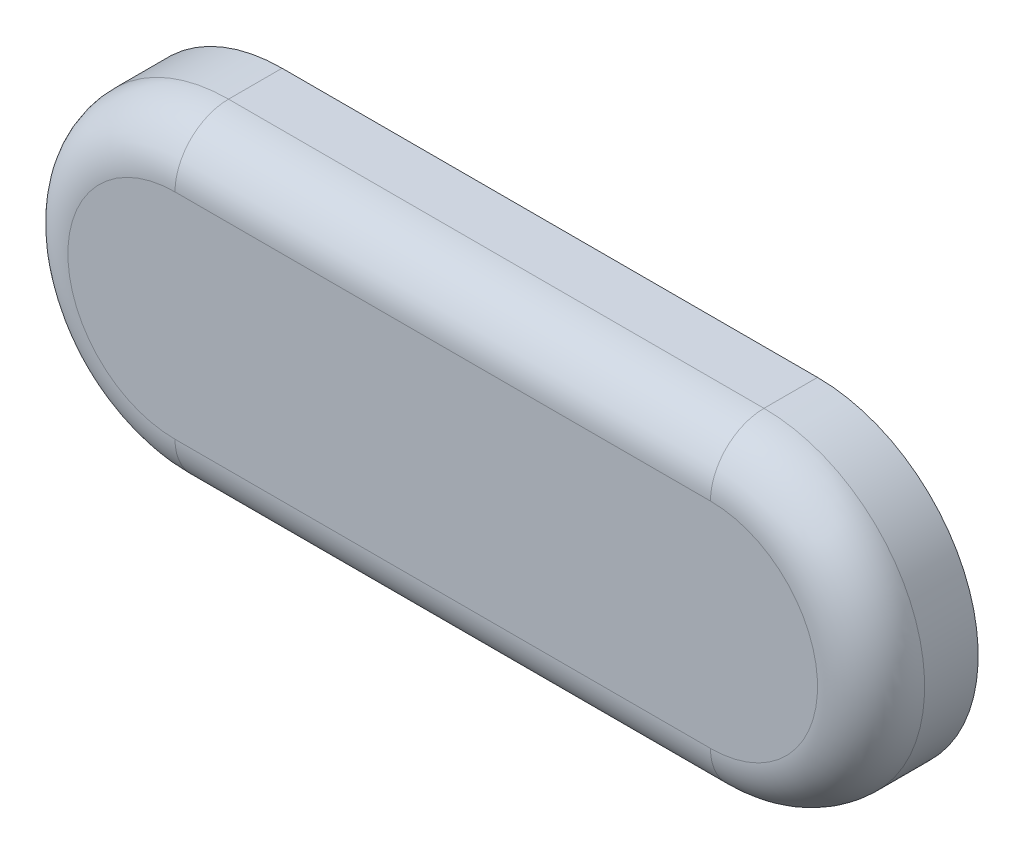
from build123d import *

# Parameters (mm, degrees)
BOSS_EXTRU_1_DEPTH = 2
CONG_1_R           = 1


with BuildPart() as part:
    # Esquisse1 → Boss.-Extru.1 (new body)
    with BuildSketch(Plane.XY):
        with BuildLine():
            Line((-5, -26.375), (5, -26.375))
            ThreePointArc((5, -26.375), (8, -23.375), (5, -20.375))
            Line((5, -20.375), (-5, -20.375))
            ThreePointArc((-5, -20.375), (-8, -23.375), (-5, -26.375))
        make_face()
    extrude(amount=BOSS_EXTRU_1_DEPTH)

    # Cong_1
    cong_1_edges = [part.edges().sort_by_distance(p)[0] for p in [
        (8, -23.375, 2),
        (0, -20.375, 2),
        (-8, -23.375, 2),
        (0, -26.375, 2),
    ]]
    fillet(cong_1_edges, radius=CONG_1_R)


solid = part.part
